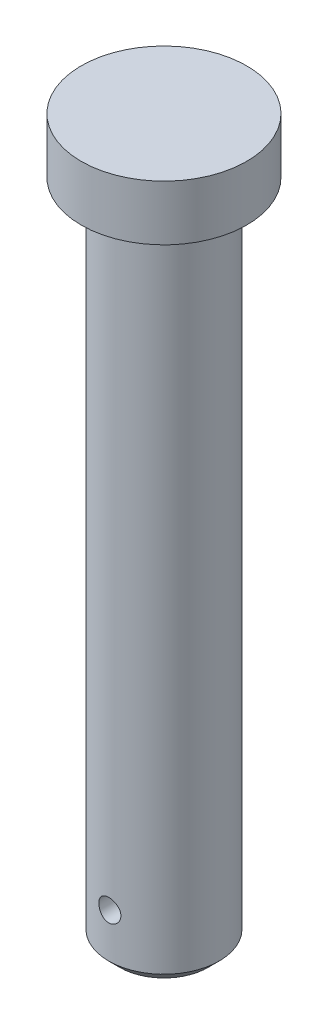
ISO-10303-21;
HEADER;
FILE_DESCRIPTION(('STEP AP214'),'2;1');
FILE_NAME('part.step','',(''),(''),'','','');
FILE_SCHEMA(('AUTOMOTIVE_DESIGN { 1 0 10303 214 1 1 1 1 }'));
ENDSEC;
DATA;
#1=APPLICATION_CONTEXT('core data for automotive mechanical design processes');
#2=APPLICATION_PROTOCOL_DEFINITION('international standard','automotive_design',2000,#1);
#3=PRODUCT_CONTEXT('',#1,'mechanical');
#4=PRODUCT('Part','Part','',(#3));
#5=PRODUCT_RELATED_PRODUCT_CATEGORY('part','',(#4));
#6=PRODUCT_DEFINITION_FORMATION('','',#4);
#7=PRODUCT_DEFINITION_CONTEXT('part definition',#1,'design');
#8=PRODUCT_DEFINITION('design','',#6,#7);
#9=PRODUCT_DEFINITION_SHAPE('','',#8);
#10=(LENGTH_UNIT() NAMED_UNIT(*) SI_UNIT(.MILLI.,.METRE.));
#11=(NAMED_UNIT(*) PLANE_ANGLE_UNIT() SI_UNIT($,.RADIAN.));
#12=(NAMED_UNIT(*) SI_UNIT($,.STERADIAN.) SOLID_ANGLE_UNIT());
#13=UNCERTAINTY_MEASURE_WITH_UNIT(LENGTH_MEASURE(1.E-05),#10,'distance_accuracy_value','');
#14=(GEOMETRIC_REPRESENTATION_CONTEXT(3) GLOBAL_UNCERTAINTY_ASSIGNED_CONTEXT((#13)) GLOBAL_UNIT_ASSIGNED_CONTEXT((#10,
#11,#12)) REPRESENTATION_CONTEXT('',''));
#15=CARTESIAN_POINT('',(0.,0.,0.));
#16=DIRECTION('',(0.,0.,1.));
#17=DIRECTION('',(1.,0.,0.));
#18=AXIS2_PLACEMENT_3D('',#15,#16,#17);
#19=CARTESIAN_POINT('',(0.,120.,0.));
#20=DIRECTION('',(0.,-1.,0.));
#21=DIRECTION('',(0.,0.,-1.));
#22=AXIS2_PLACEMENT_3D('',#19,#20,#21);
#23=CYLINDRICAL_SURFACE('',#22,10.);
#24=CARTESIAN_POINT('',(0.,1.99999999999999,0.));
#25=DIRECTION('',(0.,1.,0.));
#26=DIRECTION('',(0.,0.,1.));
#27=AXIS2_PLACEMENT_3D('',#24,#25,#26);
#28=CIRCLE('',#27,10.);
#29=CARTESIAN_POINT('',(0.,1.99999999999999,10.));
#30=VERTEX_POINT('',#29);
#31=EDGE_CURVE('E37',#30,#30,#28,.T.);
#32=ORIENTED_EDGE('',*,*,#31,.T.);
#33=EDGE_LOOP('',(#32));
#34=FACE_BOUND('',#33,.T.);
#35=CARTESIAN_POINT('',(-2.,10.,9.79795897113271));
#36=CARTESIAN_POINT('',(-1.99999589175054,9.88887124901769,9.79796118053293));
#37=CARTESIAN_POINT('',(-1.99070634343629,9.77769075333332,9.79987016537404));
#38=CARTESIAN_POINT('',(-1.95382456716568,9.55847498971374,9.80728862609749));
#39=CARTESIAN_POINT('',(-1.92621769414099,9.45044231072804,9.81280098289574));
#40=CARTESIAN_POINT('',(-1.85359156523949,9.24072539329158,9.82677747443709));
#41=CARTESIAN_POINT('',(-1.80858962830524,9.13903495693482,9.83523867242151));
#42=CARTESIAN_POINT('',(-1.70249821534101,8.94465031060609,9.85415598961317));
#43=CARTESIAN_POINT('',(-1.6414096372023,8.8519555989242,9.86461199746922));
#44=CARTESIAN_POINT('',(-1.50395815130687,8.67687799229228,9.88650599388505));
#45=CARTESIAN_POINT('',(-1.42741131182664,8.59464082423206,9.89795475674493));
#46=CARTESIAN_POINT('',(-1.26161357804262,8.44408493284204,9.92044944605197));
#47=CARTESIAN_POINT('',(-1.17236179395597,8.37576718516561,9.93149534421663));
#48=CARTESIAN_POINT('',(-0.98272271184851,8.25442396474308,9.95205592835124));
#49=CARTESIAN_POINT('',(-0.882245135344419,8.20153697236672,9.96155642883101));
#50=CARTESIAN_POINT('',(-0.673608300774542,8.11345012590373,9.97783473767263));
#51=CARTESIAN_POINT('',(-0.565449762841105,8.07824861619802,9.98461280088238));
#52=CARTESIAN_POINT('',(-0.346033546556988,8.02698561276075,9.99460641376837));
#53=CARTESIAN_POINT('',(-0.234835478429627,8.01067804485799,9.99786772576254));
#54=CARTESIAN_POINT('',(-0.0112371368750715,7.99689809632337,10.0006184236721));
#55=CARTESIAN_POINT('',(0.101163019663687,7.99942390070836,10.0001081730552));
#56=CARTESIAN_POINT('',(0.322284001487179,8.02305236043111,9.99540869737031));
#57=CARTESIAN_POINT('',(0.431034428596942,8.04388995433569,9.99127196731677));
#58=CARTESIAN_POINT('',(0.643463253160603,8.10313006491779,9.97984354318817));
#59=CARTESIAN_POINT('',(0.747141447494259,8.14153328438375,9.97255172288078));
#60=CARTESIAN_POINT('',(0.947238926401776,8.23506008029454,9.95554592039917));
#61=CARTESIAN_POINT('',(1.0436083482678,8.29028750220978,9.94581696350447));
#62=CARTESIAN_POINT('',(1.22581009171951,8.4158181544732,9.92500938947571));
#63=CARTESIAN_POINT('',(1.31164119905,8.48612311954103,9.91393061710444));
#64=CARTESIAN_POINT('',(1.47190286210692,8.64126724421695,9.89141928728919));
#65=CARTESIAN_POINT('',(1.54610863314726,8.72633837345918,9.87998392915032));
#66=CARTESIAN_POINT('',(1.67923698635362,8.90783288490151,9.85823143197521));
#67=CARTESIAN_POINT('',(1.7381592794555,9.00425648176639,9.84791431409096));
#68=CARTESIAN_POINT('',(1.83912562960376,9.20604166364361,9.82956094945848));
#69=CARTESIAN_POINT('',(1.88113329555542,9.31142193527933,9.82152963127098));
#70=CARTESIAN_POINT('',(1.94678068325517,9.52794264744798,9.80872952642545));
#71=CARTESIAN_POINT('',(1.97042279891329,9.63908233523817,9.80396031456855));
#72=CARTESIAN_POINT('',(1.9983320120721,9.86192971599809,9.79830958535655));
#73=CARTESIAN_POINT('',(2.00292371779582,9.97359514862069,9.79736294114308));
#74=CARTESIAN_POINT('',(1.99347525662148,10.1960964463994,9.79928971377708));
#75=CARTESIAN_POINT('',(1.97943614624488,10.3069323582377,9.80216291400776));
#76=CARTESIAN_POINT('',(1.93340441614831,10.5235372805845,9.81134464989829));
#77=CARTESIAN_POINT('',(1.9015852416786,10.6293446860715,9.81761998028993));
#78=CARTESIAN_POINT('',(1.82108207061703,10.8341265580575,9.83286978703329));
#79=CARTESIAN_POINT('',(1.77239668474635,10.9331004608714,9.84184448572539));
#80=CARTESIAN_POINT('',(1.65880828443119,11.1228262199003,9.86162811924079));
#81=CARTESIAN_POINT('',(1.59370215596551,11.2134540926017,9.87245943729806));
#82=CARTESIAN_POINT('',(1.44939114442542,11.3826166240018,9.89467447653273));
#83=CARTESIAN_POINT('',(1.37018481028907,11.4611500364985,9.90605825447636));
#84=CARTESIAN_POINT('',(1.19846454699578,11.6051251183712,9.92830691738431));
#85=CARTESIAN_POINT('',(1.10576499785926,11.6703473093,9.93916115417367));
#86=CARTESIAN_POINT('',(0.910535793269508,11.7842917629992,9.9589425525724));
#87=CARTESIAN_POINT('',(0.808006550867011,11.8330147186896,9.96786979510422));
#88=CARTESIAN_POINT('',(0.596605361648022,11.9122577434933,9.98274588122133));
#89=CARTESIAN_POINT('',(0.487773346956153,11.9428810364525,9.98871158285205));
#90=CARTESIAN_POINT('',(0.26637890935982,11.9853824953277,9.99706471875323));
#91=CARTESIAN_POINT('',(0.153816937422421,11.9972629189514,9.99945258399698));
#92=CARTESIAN_POINT('',(-0.0697457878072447,12.0018539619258,10.0003708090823));
#93=CARTESIAN_POINT('',(-0.180739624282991,11.9948945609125,9.99896757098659));
#94=CARTESIAN_POINT('',(-0.399942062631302,11.9627320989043,9.99260087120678));
#95=CARTESIAN_POINT('',(-0.508150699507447,11.9375292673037,9.98763745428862));
#96=CARTESIAN_POINT('',(-0.718505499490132,11.8697420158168,9.97470996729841));
#97=CARTESIAN_POINT('',(-0.820664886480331,11.8271972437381,9.9667527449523));
#98=CARTESIAN_POINT('',(-1.01644244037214,11.7259755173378,9.9486944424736));
#99=CARTESIAN_POINT('',(-1.11005993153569,11.667297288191,9.93859319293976));
#100=CARTESIAN_POINT('',(-1.28772778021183,11.5343612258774,9.91715198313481));
#101=CARTESIAN_POINT('',(-1.37159943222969,11.4598673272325,9.90579466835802));
#102=CARTESIAN_POINT('',(-1.52576523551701,11.2978995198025,9.8832244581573));
#103=CARTESIAN_POINT('',(-1.59605616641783,11.2104225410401,9.87201159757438));
#104=CARTESIAN_POINT('',(-1.72178443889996,11.0238413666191,9.85086685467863));
#105=CARTESIAN_POINT('',(-1.77705362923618,10.9246220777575,9.84095007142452));
#106=CARTESIAN_POINT('',(-1.87004809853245,10.7181344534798,9.82370474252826));
#107=CARTESIAN_POINT('',(-1.90778929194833,10.6108735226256,9.81637385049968));
#108=CARTESIAN_POINT('',(-1.95733827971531,10.4194750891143,9.8065936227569));
#109=CARTESIAN_POINT('',(-1.97330779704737,10.3364291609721,9.80337569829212));
#110=CARTESIAN_POINT('',(-1.99464003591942,10.1689320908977,9.79905756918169));
#111=CARTESIAN_POINT('',(-2.00000312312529,10.0844809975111,9.79795729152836));
#112=CARTESIAN_POINT('',(-2.,10.,9.79795897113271));
#113=B_SPLINE_CURVE_WITH_KNOTS('',3,(#35,#36,#37,#38,#39,#40,#41,#42,#43,#44,#45,#46,#47,#48,
#49,#50,#51,#52,#53,#54,#55,#56,#57,#58,#59,#60,#61,#62,#63,#64,#65,#66,#67,#68,#69,#70,#71,#72,
#73,#74,#75,#76,#77,#78,#79,#80,#81,#82,#83,#84,#85,#86,#87,#88,#89,#90,#91,#92,#93,#94,#95,#96,
#97,#98,#99,#100,#101,#102,#103,#104,#105,#106,#107,#108,#109,#110,#111,#112),.UNSPECIFIED.,.T.,
.F.,(4,2,2,2,2,2,2,2,2,2,2,2,2,2,2,2,2,2,2,2,2,2,2,2,2,2,2,2,2,2,2,2,2,2,2,2,2,2,4),(0.,
0.333076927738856,0.666420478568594,0.999432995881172,1.33242692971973,1.66964505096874,
2.00688680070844,2.34706800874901,2.6872173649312,3.02288497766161,3.35852024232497,
3.68937579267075,4.02024458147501,4.35319848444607,4.68619071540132,5.02498693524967,
5.36378956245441,5.70331726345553,6.0428007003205,6.37647515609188,6.71013069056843,
7.04058683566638,7.37107020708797,7.70586119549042,8.04068665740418,8.38065203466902,
8.7206031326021,9.05859627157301,9.39654869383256,9.72862034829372,10.0606878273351,
10.392000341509,10.7233390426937,11.0600230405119,11.3967867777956,11.7371779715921,
12.077259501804,12.3304760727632,12.5836839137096),.UNSPECIFIED.);
#114=CARTESIAN_POINT('',(-2.,10.,9.79795897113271));
#115=VERTEX_POINT('',#114);
#116=EDGE_CURVE('E55',#115,#115,#113,.T.);
#117=ORIENTED_EDGE('',*,*,#116,.F.);
#118=EDGE_LOOP('',(#117));
#119=FACE_BOUND('',#118,.T.);
#120=CARTESIAN_POINT('',(0.,120.,0.));
#121=DIRECTION('',(0.,1.,0.));
#122=DIRECTION('',(0.,0.,1.));
#123=AXIS2_PLACEMENT_3D('',#120,#121,#122);
#124=CIRCLE('',#123,10.);
#125=CARTESIAN_POINT('',(0.,120.,10.));
#126=VERTEX_POINT('',#125);
#127=EDGE_CURVE('E41',#126,#126,#124,.T.);
#128=ORIENTED_EDGE('',*,*,#127,.F.);
#129=EDGE_LOOP('',(#128));
#130=FACE_BOUND('',#129,.T.);
#131=CARTESIAN_POINT('',(0.,12.,-10.));
#132=CARTESIAN_POINT('',(0.111153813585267,11.9999959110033,-9.99999795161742));
#133=CARTESIAN_POINT('',(0.222359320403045,11.9907023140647,-9.99812770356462));
#134=CARTESIAN_POINT('',(0.441627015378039,11.9538029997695,-9.99084731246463));
#135=CARTESIAN_POINT('',(0.549686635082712,11.926182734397,-9.98543435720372));
#136=CARTESIAN_POINT('',(0.759460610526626,11.8535174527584,-9.97167298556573));
#137=CARTESIAN_POINT('',(0.861180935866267,11.8084891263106,-9.96332738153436));
#138=CARTESIAN_POINT('',(1.05561597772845,11.7023355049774,-9.94460796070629));
#139=CARTESIAN_POINT('',(1.14833123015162,11.6412111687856,-9.93423426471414));
#140=CARTESIAN_POINT('',(1.32338695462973,11.5037230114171,-9.9124433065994));
#141=CARTESIAN_POINT('',(1.40558790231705,11.4271832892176,-9.90101491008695));
#142=CARTESIAN_POINT('',(1.55607351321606,11.2614151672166,-9.87848360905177));
#143=CARTESIAN_POINT('',(1.62435708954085,11.1721857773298,-9.86738073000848));
#144=CARTESIAN_POINT('',(1.74566350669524,10.9825676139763,-9.8466488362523));
#145=CARTESIAN_POINT('',(1.79854187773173,10.8820847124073,-9.83703414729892));
#146=CARTESIAN_POINT('',(1.88661133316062,10.6734363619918,-9.82052536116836));
#147=CARTESIAN_POINT('',(1.92180416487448,10.5652716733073,-9.81363099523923));
#148=CARTESIAN_POINT('',(1.97305059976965,10.3458312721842,-9.80345610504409));
#149=CARTESIAN_POINT('',(1.98934899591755,10.2346149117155,-9.80012940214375));
#150=CARTESIAN_POINT('',(2.00310425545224,10.0109803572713,-9.79732750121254));
#151=CARTESIAN_POINT('',(2.000563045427,9.89856228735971,-9.79785190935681));
#152=CARTESIAN_POINT('',(1.97690914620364,9.677506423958,-9.80265102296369));
#153=CARTESIAN_POINT('',(1.95607708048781,9.56883718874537,-9.80686905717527));
#154=CARTESIAN_POINT('',(1.8968757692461,9.356567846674,-9.81849092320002));
#155=CARTESIAN_POINT('',(1.85850568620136,9.25296798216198,-9.82589490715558));
#156=CARTESIAN_POINT('',(1.76504956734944,9.0529694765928,-9.84311237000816));
#157=CARTESIAN_POINT('',(1.70985230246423,8.95662424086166,-9.85294179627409));
#158=CARTESIAN_POINT('',(1.58438714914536,8.77445830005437,-9.87389237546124));
#159=CARTESIAN_POINT('',(1.51411752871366,8.68863880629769,-9.88501367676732));
#160=CARTESIAN_POINT('',(1.35899986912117,8.52834119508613,-9.90754042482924));
#161=CARTESIAN_POINT('',(1.27391232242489,8.45409486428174,-9.9189473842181));
#162=CARTESIAN_POINT('',(1.09237004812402,8.32089230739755,-9.94057697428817));
#163=CARTESIAN_POINT('',(0.995915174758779,8.26193627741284,-9.95079958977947));
#164=CARTESIAN_POINT('',(0.794118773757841,8.16094498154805,-9.96893380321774));
#165=CARTESIAN_POINT('',(0.688763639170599,8.11893621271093,-9.97684177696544));
#166=CARTESIAN_POINT('',(0.472297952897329,8.05327905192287,-9.98942817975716));
#167=CARTESIAN_POINT('',(0.361188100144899,8.02962843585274,-9.99410700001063));
#168=CARTESIAN_POINT('',(0.138358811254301,8.00168709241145,-9.99965343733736));
#169=CARTESIAN_POINT('',(0.0266806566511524,7.99707916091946,-10.0005834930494));
#170=CARTESIAN_POINT('',(-0.195849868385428,8.00649971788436,-9.99870103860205));
#171=CARTESIAN_POINT('',(-0.306702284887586,8.02052715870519,-9.99588873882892));
#172=CARTESIAN_POINT('',(-0.523411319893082,8.06655674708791,-9.98687664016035));
#173=CARTESIAN_POINT('',(-0.629303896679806,8.09839613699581,-9.98070752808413));
#174=CARTESIAN_POINT('',(-0.834247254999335,8.17896796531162,-9.96567104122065));
#175=CARTESIAN_POINT('',(-0.933297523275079,8.22770166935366,-9.95680346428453));
#176=CARTESIAN_POINT('',(-1.12308234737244,8.34136498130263,-9.93719823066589));
#177=CARTESIAN_POINT('',(-1.21370025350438,8.40648556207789,-9.92643900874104));
#178=CARTESIAN_POINT('',(-1.38283603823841,8.55081838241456,-9.90429469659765));
#179=CARTESIAN_POINT('',(-1.46135261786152,8.63003213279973,-9.89290953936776));
#180=CARTESIAN_POINT('',(-1.60528118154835,8.80174670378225,-9.8705860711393));
#181=CARTESIAN_POINT('',(-1.67047540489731,8.89443148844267,-9.85965720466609));
#182=CARTESIAN_POINT('',(-1.78437084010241,9.08962272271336,-9.83968383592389));
#183=CARTESIAN_POINT('',(-1.83307271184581,9.1921287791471,-9.83063925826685));
#184=CARTESIAN_POINT('',(-1.91230368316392,9.4035364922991,-9.81553481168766));
#185=CARTESIAN_POINT('',(-1.9429269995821,9.51240168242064,-9.80945949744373));
#186=CARTESIAN_POINT('',(-1.98541730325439,9.73386690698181,-9.8009487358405));
#187=CARTESIAN_POINT('',(-1.99728673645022,9.84646645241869,-9.79851281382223));
#188=CARTESIAN_POINT('',(-2.00184182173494,10.0700177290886,-9.79758299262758));
#189=CARTESIAN_POINT('',(-1.99487157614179,10.180962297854,-9.79901838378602));
#190=CARTESIAN_POINT('',(-1.96270460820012,10.4000632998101,-9.80551146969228));
#191=CARTESIAN_POINT('',(-1.9375080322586,10.5082197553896,-9.81056913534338));
#192=CARTESIAN_POINT('',(-1.86975713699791,10.7184554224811,-9.82370528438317));
#193=CARTESIAN_POINT('',(-1.82724501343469,10.8205487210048,-9.83177642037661));
#194=CARTESIAN_POINT('',(-1.72610928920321,11.0162074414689,-9.85003429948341));
#195=CARTESIAN_POINT('',(-1.66748433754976,11.1097721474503,-9.86022121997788));
#196=CARTESIAN_POINT('',(-1.53461182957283,11.2874311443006,-9.88177921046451));
#197=CARTESIAN_POINT('',(-1.46011577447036,11.3713375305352,-9.89316745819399));
#198=CARTESIAN_POINT('',(-1.29812873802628,11.5255724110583,-9.91572163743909));
#199=CARTESIAN_POINT('',(-1.21063477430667,11.5958977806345,-9.92688751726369));
#200=CARTESIAN_POINT('',(-1.02403525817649,11.7216692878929,-9.94787664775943));
#201=CARTESIAN_POINT('',(-0.924817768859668,11.7769520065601,-9.95768462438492));
#202=CARTESIAN_POINT('',(-0.718332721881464,11.8699722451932,-9.9747025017));
#203=CARTESIAN_POINT('',(-0.611072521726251,11.907725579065,-9.98191474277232));
#204=CARTESIAN_POINT('',(-0.419642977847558,11.9573038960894,-9.99152745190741));
#205=CARTESIAN_POINT('',(-0.336563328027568,11.9732863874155,-9.99468606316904));
#206=CARTESIAN_POINT('',(-0.168999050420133,11.9946358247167,-9.99892308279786));
#207=CARTESIAN_POINT('',(-0.0845144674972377,12.0000031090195,-10.0000015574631));
#208=CARTESIAN_POINT('',(0.,12.,-10.));
#209=B_SPLINE_CURVE_WITH_KNOTS('',3,(#131,#132,#133,#134,#135,#136,#137,#138,#139,#140,#141,
#142,#143,#144,#145,#146,#147,#148,#149,#150,#151,#152,#153,#154,#155,#156,#157,#158,#159,#160,
#161,#162,#163,#164,#165,#166,#167,#168,#169,#170,#171,#172,#173,#174,#175,#176,#177,#178,#179,
#180,#181,#182,#183,#184,#185,#186,#187,#188,#189,#190,#191,#192,#193,#194,#195,#196,#197,#198,
#199,#200,#201,#202,#203,#204,#205,#206,#207,#208),.UNSPECIFIED.,.T.,.F.,(4,2,2,2,2,2,2,2,2,2,2,
2,2,2,2,2,2,2,2,2,2,2,2,2,2,2,2,2,2,2,2,2,2,2,2,2,2,2,4),(0.,0.333152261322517,
0.666569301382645,0.999667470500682,1.33274580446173,1.66986534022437,2.00701119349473,
2.34722390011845,2.68740298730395,3.02312370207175,3.3588100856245,3.68943454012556,
4.02007478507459,4.35294980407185,4.68586309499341,5.02476504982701,5.3636713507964,
5.70310549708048,6.04249851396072,6.3762147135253,6.70991215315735,7.04060907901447,
7.37133078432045,7.70610132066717,8.0409077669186,8.38081257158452,8.72070377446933,
9.05880762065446,9.3968673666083,9.72879445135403,10.0607188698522,10.3918392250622,
10.7229873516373,11.0597615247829,11.3966130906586,11.7369899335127,12.0770591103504,
12.3303755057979,12.5836838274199),.UNSPECIFIED.);
#210=CARTESIAN_POINT('',(0.,12.,-10.));
#211=VERTEX_POINT('',#210);
#212=EDGE_CURVE('E48',#211,#211,#209,.T.);
#213=ORIENTED_EDGE('',*,*,#212,.F.);
#214=EDGE_LOOP('',(#213));
#215=FACE_BOUND('',#214,.T.);
#216=ADVANCED_FACE('F30',(#34,#119,#130,#215),#23,.T.);
#217=CARTESIAN_POINT('',(0.,0.,0.));
#218=DIRECTION('',(0.,1.,0.));
#219=DIRECTION('',(0.,0.,1.));
#220=AXIS2_PLACEMENT_3D('',#217,#218,#219);
#221=PLANE('',#220);
#222=CARTESIAN_POINT('',(0.,0.,0.));
#223=DIRECTION('',(0.,1.,0.));
#224=DIRECTION('',(0.,0.,1.));
#225=AXIS2_PLACEMENT_3D('',#222,#223,#224);
#226=CIRCLE('',#225,8.00000000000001);
#227=CARTESIAN_POINT('',(0.,0.,8.00000000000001));
#228=VERTEX_POINT('',#227);
#229=EDGE_CURVE('E10',#228,#228,#226,.F.);
#230=ORIENTED_EDGE('',*,*,#229,.T.);
#231=EDGE_LOOP('',(#230));
#232=FACE_BOUND('',#231,.T.);
#233=ADVANCED_FACE('F74',(#232),#221,.F.);
#234=CARTESIAN_POINT('',(0.,120.,0.));
#235=DIRECTION('',(0.,1.,0.));
#236=DIRECTION('',(0.,0.,1.));
#237=AXIS2_PLACEMENT_3D('',#234,#235,#236);
#238=PLANE('',#237);
#239=CARTESIAN_POINT('',(0.,120.,0.));
#240=DIRECTION('',(0.,1.,0.));
#241=DIRECTION('',(0.,0.,1.));
#242=AXIS2_PLACEMENT_3D('',#239,#240,#241);
#243=CIRCLE('',#242,15.);
#244=CARTESIAN_POINT('',(0.,120.,15.));
#245=VERTEX_POINT('',#244);
#246=EDGE_CURVE('E54',#245,#245,#243,.T.);
#247=ORIENTED_EDGE('',*,*,#246,.F.);
#248=EDGE_LOOP('',(#247));
#249=FACE_BOUND('',#248,.T.);
#250=ORIENTED_EDGE('',*,*,#127,.T.);
#251=EDGE_LOOP('',(#250));
#252=FACE_BOUND('',#251,.T.);
#253=ADVANCED_FACE('F71',(#249,#252),#238,.F.);
#254=CARTESIAN_POINT('',(0.,130.,0.));
#255=DIRECTION('',(0.,-1.,0.));
#256=DIRECTION('',(0.,0.,-1.));
#257=AXIS2_PLACEMENT_3D('',#254,#255,#256);
#258=CYLINDRICAL_SURFACE('',#257,15.);
#259=CARTESIAN_POINT('',(0.,130.,0.));
#260=DIRECTION('',(0.,1.,0.));
#261=DIRECTION('',(0.,0.,1.));
#262=AXIS2_PLACEMENT_3D('',#259,#260,#261);
#263=CIRCLE('',#262,15.);
#264=CARTESIAN_POINT('',(0.,130.,15.));
#265=VERTEX_POINT('',#264);
#266=EDGE_CURVE('E45',#265,#265,#263,.T.);
#267=ORIENTED_EDGE('',*,*,#266,.F.);
#268=EDGE_LOOP('',(#267));
#269=FACE_BOUND('',#268,.T.);
#270=ORIENTED_EDGE('',*,*,#246,.T.);
#271=EDGE_LOOP('',(#270));
#272=FACE_BOUND('',#271,.T.);
#273=ADVANCED_FACE('F69',(#269,#272),#258,.T.);
#274=CARTESIAN_POINT('',(0.,130.,0.));
#275=DIRECTION('',(0.,1.,0.));
#276=DIRECTION('',(0.,0.,1.));
#277=AXIS2_PLACEMENT_3D('',#274,#275,#276);
#278=PLANE('',#277);
#279=ORIENTED_EDGE('',*,*,#266,.T.);
#280=EDGE_LOOP('',(#279));
#281=FACE_BOUND('',#280,.T.);
#282=ADVANCED_FACE('F64',(#281),#278,.T.);
#283=CARTESIAN_POINT('',(0.,10.,15.));
#284=DIRECTION('',(0.,0.,-1.));
#285=DIRECTION('',(-1.,0.,0.));
#286=AXIS2_PLACEMENT_3D('',#283,#284,#285);
#287=CYLINDRICAL_SURFACE('',#286,2.);
#288=ORIENTED_EDGE('',*,*,#116,.T.);
#289=EDGE_LOOP('',(#288));
#290=FACE_BOUND('',#289,.T.);
#291=ORIENTED_EDGE('',*,*,#212,.T.);
#292=EDGE_LOOP('',(#291));
#293=FACE_BOUND('',#292,.T.);
#294=ADVANCED_FACE('F60',(#290,#293),#287,.F.);
#295=CARTESIAN_POINT('',(0.,1.99999999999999,0.));
#296=DIRECTION('',(0.,1.,0.));
#297=DIRECTION('',(0.,0.,1.));
#298=AXIS2_PLACEMENT_3D('',#295,#296,#297);
#299=CONICAL_SURFACE('',#298,10.,0.78539816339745);
#300=ORIENTED_EDGE('',*,*,#229,.F.);
#301=EDGE_LOOP('',(#300));
#302=FACE_BOUND('',#301,.T.);
#303=ORIENTED_EDGE('',*,*,#31,.F.);
#304=EDGE_LOOP('',(#303));
#305=FACE_BOUND('',#304,.T.);
#306=ADVANCED_FACE('F32',(#302,#305),#299,.T.);
#307=CLOSED_SHELL('',(#216,#233,#253,#273,#282,#294,#306));
#308=MANIFOLD_SOLID_BREP('B2',#307);
#309=ADVANCED_BREP_SHAPE_REPRESENTATION('',(#18,#308),#14);
#310=SHAPE_DEFINITION_REPRESENTATION(#9,#309);
ENDSEC;
END-ISO-10303-21;
